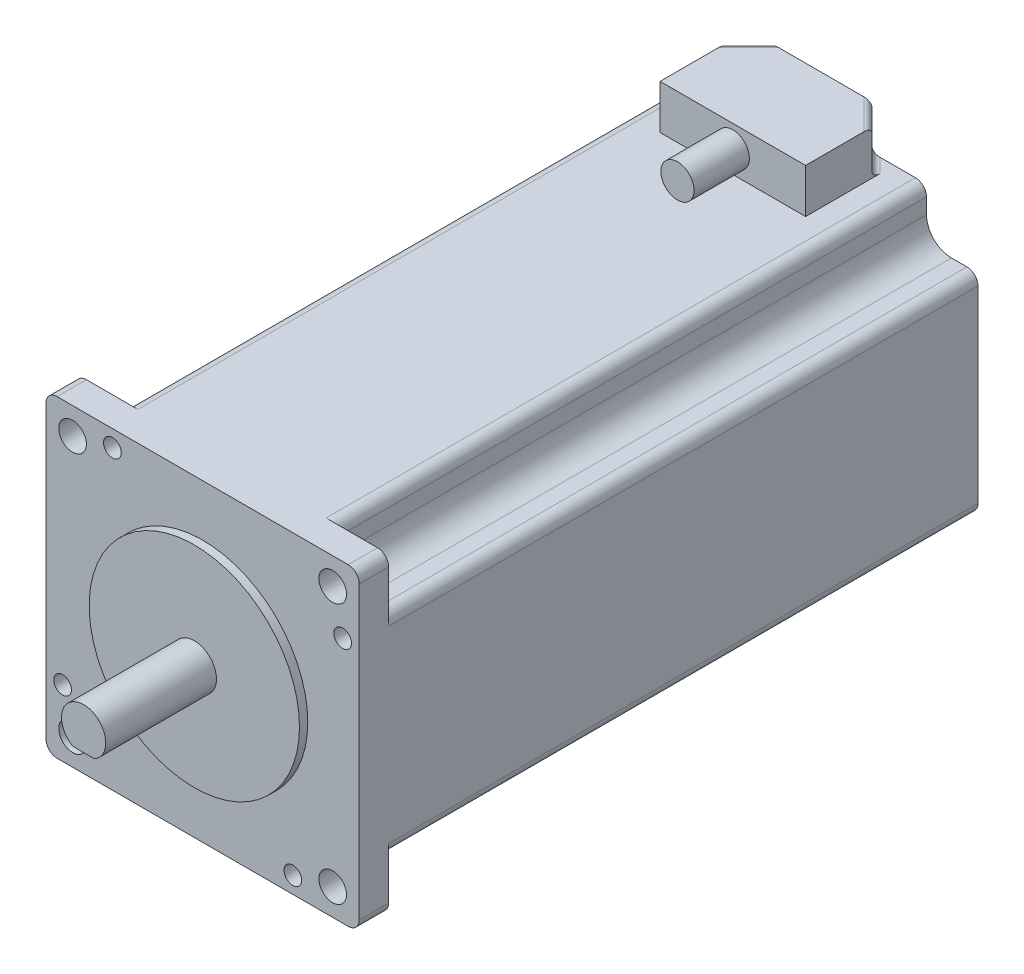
from build123d import *

# Parameters (mm, degrees)
CROQUIS1_W              = 56.6
CROQUIS1_H              = 56.6
SALIENTE_EXTRUIR1_DEPTH = 5.3
SALIENTE_EXTRUIR2_DEPTH = 106.5
CROQUIS3_R              = 19
SALIENTE_EXTRUIR3_DEPTH = 1.5
CROQUIS4_R              = 4
SALIENTE_EXTRUIR4_DEPTH = 20
CORTAR_EXTRUIR2_START   = -18
CORTAR_EXTRUIR2_DEPTH   = 18
CROQUIS6_R              = 2.5
CORTAR_EXTRUIR3_DEPTH   = 18
REDONDEO2_R             = 2
CROQUIS7_W              = 26.3
CROQUIS7_H              = 16
SALIENTE_EXTRUIR5_DEPTH = 8
CHAFL_N1_SIZE           = 4
CROQUIS8_R              = 3
SALIENTE_EXTRUIR6_DEPTH = 10
CORTAR_EXTRUIR4_START   = -106.5
CORTAR_EXTRUIR4_DEPTH   = 106.5
REDONDEO3_R             = 1
SKETCH1_R               = 1.6
CUT_EXTRUDE1_DEPTH      = 150
FILLET1_R               = 2
CIRPATTERN1_COUNT       = 4


with BuildPart() as part:
    # Croquis1 → Saliente-Extruir1 (new body)
    with BuildSketch(Plane.XY):
        Rectangle(CROQUIS1_W, CROQUIS1_H)
    extrude(amount=SALIENTE_EXTRUIR1_DEPTH)

    # Croquis2 → Saliente-Extruir2 (add)
    with BuildSketch(Plane(origin=(0, 0, 0), x_dir=(-1, 0, 0), z_dir=(0, 0, -1))):
        with BuildLine():
            Line((20.8, 28.3), (-20.8, 28.3))
            ThreePointArc((-20.8, 28.3), (-22.996699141, 22.996699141), (-28.3, 20.8))
            Line((-28.3, 20.8), (-28.3, -20.8))
            ThreePointArc((-28.3, -20.8), (-22.996699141, -22.996699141), (-20.8, -28.3))
            Line((-20.8, -28.3), (20.8, -28.3))
            ThreePointArc((20.8, -28.3), (22.996699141, -22.996699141), (28.3, -20.8))
            Line((28.3, -20.8), (28.3, 20.8))
            ThreePointArc((28.3, 20.8), (22.996699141, 22.996699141), (20.8, 28.3))
        make_face()
    extrude(amount=SALIENTE_EXTRUIR2_DEPTH)

    # Croquis3 → Saliente-Extruir3 (add)
    with BuildSketch(Plane.XY.offset(5.3)):
        Circle(CROQUIS3_R)
    extrude(amount=SALIENTE_EXTRUIR3_DEPTH)

    # Croquis4 → Saliente-Extruir4 (add)
    with BuildSketch(Plane.XY.offset(6.8)):
        Circle(CROQUIS4_R)
    extrude(amount=SALIENTE_EXTRUIR4_DEPTH)

    # Croquis5 → Cortar-Extruir2 (cut)
    with BuildSketch(Plane.XY.offset(26.8).offset(CORTAR_EXTRUIR2_START)):
        with BuildLine():
            Line((1.936491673, -3.5), (-1.936491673, -3.5))
            ThreePointArc((-1.936491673, -3.5), (0, -4), (1.936491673, -3.5))
        make_face()
    extrude(amount=CORTAR_EXTRUIR2_DEPTH, mode=Mode.SUBTRACT)

    # Croquis6 → Cortar-Extruir3 (cut)
    with BuildSketch(Plane.XY.offset(5.3)):
        with Locations((23.5, 23.5)):
            Circle(CROQUIS6_R)
        with Locations((-23.5, 23.5)):
            Circle(CROQUIS6_R)
        with Locations((-23.5, -23.5)):
            Circle(CROQUIS6_R)
        with Locations((23.5, -23.5)):
            Circle(CROQUIS6_R)
    extrude(amount=-CORTAR_EXTRUIR3_DEPTH, mode=Mode.SUBTRACT)

    # Redondeo2
    redondeo2_edges = [part.edges().sort_by_distance(p)[0] for p in [
        (28.3, -28.3, 2.65),
        (-28.3, -28.3, 2.65),
        (-28.3, 28.3, 2.65),
        (28.3, 28.3, 2.65),
    ]]
    fillet(redondeo2_edges, radius=REDONDEO2_R)

    # Croquis7 → Saliente-Extruir5 (add)
    with BuildSketch(Plane(origin=(0, 28.3, 0), x_dir=(1, 0, 0), z_dir=(0, 1, 0))):
        with Locations((0, 98.5)):
            Rectangle(CROQUIS7_W, CROQUIS7_H)
    extrude(amount=SALIENTE_EXTRUIR5_DEPTH)

    # Chafl_n1
    chafl_n1_edges = [part.edges().sort_by_distance(p)[0] for p in [
        (-13.15, 32.3, -106.5),
        (13.15, 32.3, -106.5),
    ]]
    chamfer(chafl_n1_edges, length=CHAFL_N1_SIZE)

    # Croquis8 → Saliente-Extruir6 (add)
    with BuildSketch(Plane.XY.offset(-90.5)):
        with Locations(Location((0, 32.3, 0), (0, 0, 180))):
            Circle(CROQUIS8_R)
    extrude(amount=SALIENTE_EXTRUIR6_DEPTH)

    # Croquis10 → Cortar-Extruir4 (cut)
    with BuildSketch(Plane(origin=(0, 0, -106.5), x_dir=(-1, 0, 0), z_dir=(0, 0, -1)).offset(CORTAR_EXTRUIR4_START)):
        with BuildLine():
            Line((-28.3, 19), (-23.5, 19))
            ThreePointArc((-23.5, 19), (-25.560318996, 19.499364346), (-27.163371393, 20.886628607))
            ThreePointArc((-27.163371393, 20.886628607), (-27.730037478, 20.821688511), (-28.3, 20.8))
            Line((-28.3, 20.8), (-28.3, 19))
        make_face()
        with BuildLine():
            ThreePointArc((-27.163371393, 20.886628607), (-25.560318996, 19.499364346), (-23.5, 19))
            ThreePointArc((-23.5, 19), (-20.318019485, 20.318019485), (-19, 23.5))
            ThreePointArc((-19, 23.5), (-19.499364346, 25.560318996), (-20.886628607, 27.163371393))
            ThreePointArc((-20.886628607, 27.163371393), (-22.996699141, 22.996699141), (-27.163371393, 20.886628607))
        make_face()
        with BuildLine():
            ThreePointArc((-20.886628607, 27.163371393), (-19.499364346, 25.560318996), (-19, 23.5))
            Line((-19, 23.5), (-19, 28.3))
            Line((-19, 28.3), (-20.8, 28.3))
            ThreePointArc((-20.8, 28.3), (-20.821688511, 27.730037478), (-20.886628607, 27.163371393))
        make_face()
        with BuildLine():
            Line((19, 28.3), (19, 23.5))
            ThreePointArc((19, 23.5), (19.499364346, 25.560318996), (20.886628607, 27.163371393))
            ThreePointArc((20.886628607, 27.163371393), (20.821688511, 27.730037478), (20.8, 28.3))
            Line((20.8, 28.3), (19, 28.3))
        make_face()
        with BuildLine():
            ThreePointArc((19, 23.5), (20.318019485, 20.318019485), (23.5, 19))
            ThreePointArc((23.5, 19), (25.560318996, 19.499364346), (27.163371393, 20.886628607))
            ThreePointArc((27.163371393, 20.886628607), (22.996699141, 22.996699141), (20.886628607, 27.163371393))
            ThreePointArc((20.886628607, 27.163371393), (19.499364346, 25.560318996), (19, 23.5))
        make_face()
        with BuildLine():
            Line((23.5, 19), (28.3, 19))
            Line((28.3, 19), (28.3, 20.8))
            ThreePointArc((28.3, 20.8), (27.730037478, 20.821688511), (27.163371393, 20.886628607))
            ThreePointArc((27.163371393, 20.886628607), (25.560318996, 19.499364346), (23.5, 19))
        make_face()
        with BuildLine():
            ThreePointArc((23.5, -19), (20.318019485, -20.318019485), (19, -23.5))
            ThreePointArc((19, -23.5), (19.499364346, -25.560318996), (20.886628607, -27.163371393))
            ThreePointArc((20.886628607, -27.163371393), (22.996699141, -22.996699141), (27.163371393, -20.886628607))
            ThreePointArc((27.163371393, -20.886628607), (25.560318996, -19.499364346), (23.5, -19))
        make_face()
        with BuildLine():
            Line((19, -23.5), (19, -28.3))
            Line((19, -28.3), (20.8, -28.3))
            ThreePointArc((20.8, -28.3), (20.821688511, -27.730037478), (20.886628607, -27.163371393))
            ThreePointArc((20.886628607, -27.163371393), (19.499364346, -25.560318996), (19, -23.5))
        make_face()
        with BuildLine():
            Line((28.3, -19), (23.5, -19))
            ThreePointArc((23.5, -19), (25.560318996, -19.499364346), (27.163371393, -20.886628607))
            ThreePointArc((27.163371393, -20.886628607), (27.730037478, -20.821688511), (28.3, -20.8))
            Line((28.3, -20.8), (28.3, -19))
        make_face()
        with BuildLine():
            Line((-23.5, -19), (-28.3, -19))
            Line((-28.3, -19), (-28.3, -20.8))
            ThreePointArc((-28.3, -20.8), (-27.730037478, -20.821688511), (-27.163371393, -20.886628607))
            ThreePointArc((-27.163371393, -20.886628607), (-25.560318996, -19.499364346), (-23.5, -19))
        make_face()
        with BuildLine():
            ThreePointArc((-19, -23.5), (-20.318019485, -20.318019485), (-23.5, -19))
            ThreePointArc((-23.5, -19), (-25.560318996, -19.499364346), (-27.163371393, -20.886628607))
            ThreePointArc((-27.163371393, -20.886628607), (-22.996699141, -22.996699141), (-20.886628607, -27.163371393))
            ThreePointArc((-20.886628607, -27.163371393), (-19.499364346, -25.560318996), (-19, -23.5))
        make_face()
        with BuildLine():
            Line((-19, -28.3), (-19, -23.5))
            ThreePointArc((-19, -23.5), (-19.499364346, -25.560318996), (-20.886628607, -27.163371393))
            ThreePointArc((-20.886628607, -27.163371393), (-20.821688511, -27.730037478), (-20.8, -28.3))
            Line((-20.8, -28.3), (-19, -28.3))
        make_face()
    extrude(amount=CORTAR_EXTRUIR4_DEPTH, mode=Mode.SUBTRACT)

    # Redondeo3
    redondeo3_edges = [part.edges().sort_by_distance(p)[0] for p in [
        (-11.15, 36.3, -104.5),
        (11.15, 36.3, -104.5),
        (11.15, 28.3, -104.5),
        (-11.15, 28.3, -104.5),
    ]]
    fillet(redondeo3_edges, radius=REDONDEO3_R)

    # Sketch1 → Cut-Extrude1 (cut)
    with BuildSketch(Plane(origin=(0, 0, -106.5), x_dir=(-1, 0, 0), z_dir=(0, 0, -1))):
        with Locations((16.3, 25.3)):
            Circle(SKETCH1_R)
    cut_extrude1 = extrude(amount=-CUT_EXTRUDE1_DEPTH, mode=Mode.SUBTRACT)

    # Fillet1
    fillet1_edges = [part.edges().sort_by_distance(p)[0] for p in [
        (19, -28.3, -53.25),
        (28.3, -19, -53.25),
        (-19, -28.3, -53.25),
        (-28.3, -19, -53.25),
        (-28.3, 19, -53.25),
        (-19, 28.3, -53.25),
        (19, 28.3, -53.25),
        (28.3, 19, -53.25),
    ]]
    fillet(fillet1_edges, radius=FILLET1_R)

    # CirPattern1: Cut-Extrude1 ×4 about axis
    cirpattern1_axis = Axis((0, 0, 0), (0, 0, 1))
    for i in range(1, CIRPATTERN1_COUNT):
        add(cut_extrude1.rotate(cirpattern1_axis, i * 360 / CIRPATTERN1_COUNT), mode=Mode.SUBTRACT)


solid = part.part
